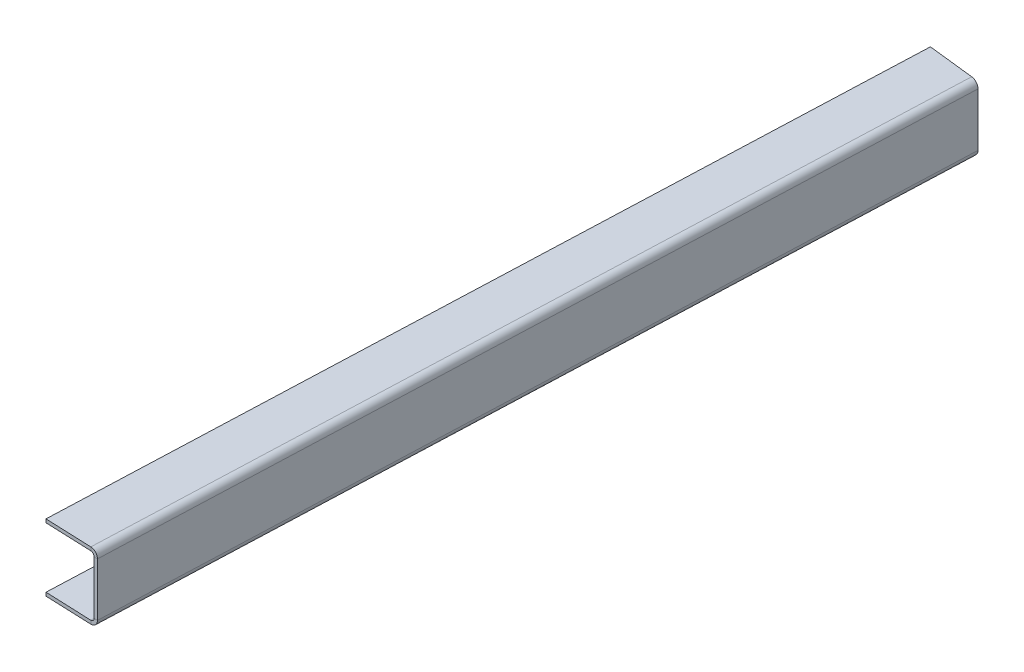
ISO-10303-21;
HEADER;
FILE_DESCRIPTION(('STEP AP214'),'2;1');
FILE_NAME('part.step','',(''),(''),'','','');
FILE_SCHEMA(('AUTOMOTIVE_DESIGN { 1 0 10303 214 1 1 1 1 }'));
ENDSEC;
DATA;
#1=APPLICATION_CONTEXT('core data for automotive mechanical design processes');
#2=APPLICATION_PROTOCOL_DEFINITION('international standard','automotive_design',2000,#1);
#3=PRODUCT_CONTEXT('',#1,'mechanical');
#4=PRODUCT('Part','Part','',(#3));
#5=PRODUCT_RELATED_PRODUCT_CATEGORY('part','',(#4));
#6=PRODUCT_DEFINITION_FORMATION('','',#4);
#7=PRODUCT_DEFINITION_CONTEXT('part definition',#1,'design');
#8=PRODUCT_DEFINITION('design','',#6,#7);
#9=PRODUCT_DEFINITION_SHAPE('','',#8);
#10=(LENGTH_UNIT() NAMED_UNIT(*) SI_UNIT(.MILLI.,.METRE.));
#11=(NAMED_UNIT(*) PLANE_ANGLE_UNIT() SI_UNIT($,.RADIAN.));
#12=(NAMED_UNIT(*) SI_UNIT($,.STERADIAN.) SOLID_ANGLE_UNIT());
#13=UNCERTAINTY_MEASURE_WITH_UNIT(LENGTH_MEASURE(1.E-05),#10,'distance_accuracy_value','');
#14=(GEOMETRIC_REPRESENTATION_CONTEXT(3) GLOBAL_UNCERTAINTY_ASSIGNED_CONTEXT((#13)) GLOBAL_UNIT_ASSIGNED_CONTEXT((#10,
#11,#12)) REPRESENTATION_CONTEXT('',''));
#15=CARTESIAN_POINT('',(0.,0.,0.));
#16=DIRECTION('',(0.,0.,1.));
#17=DIRECTION('',(1.,0.,0.));
#18=AXIS2_PLACEMENT_3D('',#15,#16,#17);
#19=CARTESIAN_POINT('',(-155.002975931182,0.,-777.838500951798));
#20=DIRECTION('',(0.0392134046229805,0.,-0.999230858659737));
#21=DIRECTION('',(0.,1.,0.));
#22=AXIS2_PLACEMENT_3D('',#19,#20,#21);
#23=PLANE('',#22);
#24=DIRECTION('',(-0.999230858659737,0.,-0.0392134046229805));
#25=VECTOR('',#24,1.);
#26=CARTESIAN_POINT('',(-155.002975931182,962.717491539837,-777.838500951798));
#27=LINE('',#26,#25);
#28=CARTESIAN_POINT('',(-153.378626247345,962.717491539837,-777.774755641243));
#29=VERTEX_POINT('',#28);
#30=CARTESIAN_POINT('',(-155.002975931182,962.717491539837,-777.838500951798));
#31=VERTEX_POINT('',#30);
#32=EDGE_CURVE('E12',#29,#31,#27,.T.);
#33=ORIENTED_EDGE('',*,*,#32,.F.);
#34=DIRECTION('',(0.,1.,0.));
#35=VECTOR('',#34,1.);
#36=CARTESIAN_POINT('',(-153.378626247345,0.,-777.774755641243));
#37=LINE('',#36,#35);
#38=CARTESIAN_POINT('',(-153.378626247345,987.965091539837,-777.774755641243));
#39=VERTEX_POINT('',#38);
#40=EDGE_CURVE('E137',#29,#39,#37,.T.);
#41=ORIENTED_EDGE('',*,*,#40,.T.);
#42=DIRECTION('',(-0.999230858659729,0.,-0.0392134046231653));
#43=VECTOR('',#42,1.);
#44=CARTESIAN_POINT('',(-155.002975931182,987.965091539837,-777.838500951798));
#45=LINE('',#44,#43);
#46=CARTESIAN_POINT('',(-155.002975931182,987.965091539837,-777.838500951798));
#47=VERTEX_POINT('',#46);
#48=EDGE_CURVE('E90',#39,#47,#45,.T.);
#49=ORIENTED_EDGE('',*,*,#48,.T.);
#50=DIRECTION('',(0.,1.,0.));
#51=VECTOR('',#50,1.);
#52=CARTESIAN_POINT('',(-155.002975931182,0.,-777.838500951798));
#53=LINE('',#52,#51);
#54=EDGE_CURVE('E139',#31,#47,#53,.T.);
#55=ORIENTED_EDGE('',*,*,#54,.F.);
#56=EDGE_LOOP('',(#33,#41,#49,#55));
#57=FACE_BOUND('',#56,.T.);
#58=ADVANCED_FACE('F78',(#57),#23,.F.);
#59=CARTESIAN_POINT('',(-158.251604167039,987.965091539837,-777.967804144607));
#60=CARTESIAN_POINT('',(-158.793054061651,987.965091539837,-777.989052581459));
#61=CARTESIAN_POINT('',(-159.334503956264,987.965091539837,-778.01030101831));
#62=CARTESIAN_POINT('',(-159.875953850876,987.965091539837,-778.031549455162));
#63=CARTESIAN_POINT('',(-158.251604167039,984.713891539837,-777.967804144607));
#64=CARTESIAN_POINT('',(-158.793054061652,983.630158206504,-777.989052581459));
#65=CARTESIAN_POINT('',(-159.334503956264,982.54642487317,-778.010301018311));
#66=CARTESIAN_POINT('',(-159.875953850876,981.462691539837,-778.031549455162));
#67=CARTESIAN_POINT('',(-155.002975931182,984.713891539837,-777.838500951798));
#68=CARTESIAN_POINT('',(-154.46152603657,983.630158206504,-777.817252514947));
#69=CARTESIAN_POINT('',(-153.920076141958,982.54642487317,-777.796004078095));
#70=CARTESIAN_POINT('',(-153.378626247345,981.462691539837,-777.774755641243));
#71=CARTESIAN_POINT('',(-155.002975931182,987.965091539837,-777.838500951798));
#72=CARTESIAN_POINT('',(-154.46152603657,987.965091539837,-777.817252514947));
#73=CARTESIAN_POINT('',(-153.920076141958,987.965091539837,-777.796004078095));
#74=CARTESIAN_POINT('',(-153.378626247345,987.965091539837,-777.774755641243));
#75=CARTESIAN_POINT('',(-155.002975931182,991.216291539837,-777.838500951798));
#76=CARTESIAN_POINT('',(-154.46152603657,992.30002487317,-777.817252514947));
#77=CARTESIAN_POINT('',(-153.920076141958,993.383758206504,-777.796004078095));
#78=CARTESIAN_POINT('',(-153.378626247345,994.467491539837,-777.774755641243));
#79=CARTESIAN_POINT('',(-158.251604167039,991.216291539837,-777.967804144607));
#80=CARTESIAN_POINT('',(-158.793054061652,992.30002487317,-777.989052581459));
#81=CARTESIAN_POINT('',(-159.334503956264,993.383758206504,-778.010301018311));
#82=CARTESIAN_POINT('',(-159.875953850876,994.467491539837,-778.031549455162));
#83=CARTESIAN_POINT('',(-158.251604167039,987.965091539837,-777.967804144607));
#84=CARTESIAN_POINT('',(-158.793054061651,987.965091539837,-777.989052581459));
#85=CARTESIAN_POINT('',(-159.334503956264,987.965091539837,-778.01030101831));
#86=CARTESIAN_POINT('',(-159.875953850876,987.965091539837,-778.031549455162));
#87=(BOUNDED_SURFACE() B_SPLINE_SURFACE(3,3,((#59,#60,#61,#62),(#63,#64,#65,#66),(#67,#68,#69,
#70),(#71,#72,#73,#74),(#75,#76,#77,#78),(#79,#80,#81,#82),(#83,#84,#85,#86)),.UNSPECIFIED.,.T.,
.F.,.F.) B_SPLINE_SURFACE_WITH_KNOTS((4,3,4),(4,4),(0.,0.5,1.),(0.,1.),
.UNSPECIFIED.) GEOMETRIC_REPRESENTATION_ITEM() RATIONAL_B_SPLINE_SURFACE(((1.,1.,1.,1.),
(0.333333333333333,0.333333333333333,0.333333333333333,0.333333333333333),(0.333333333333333,
0.333333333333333,0.333333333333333,0.333333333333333),(1.,1.,1.,1.),(0.333333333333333,
0.333333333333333,0.333333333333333,0.333333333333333),(0.333333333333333,0.333333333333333,
0.333333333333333,0.333333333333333),(1.,1.,1.,1.))) REPRESENTATION_ITEM('') SURFACE());
#88=CARTESIAN_POINT('',(-156.627290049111,987.965091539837,-777.903152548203));
#89=DIRECTION('',(-0.0394921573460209,0.,0.999219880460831));
#90=DIRECTION('',(-0.999219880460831,0.,-0.0394921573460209));
#91=AXIS2_PLACEMENT_3D('',#88,#89,#90);
#92=ELLIPSE('',#91,3.25120012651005,3.2512);
#93=CARTESIAN_POINT('',(-156.627290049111,991.216291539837,-777.903152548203));
#94=VERTEX_POINT('',#93);
#95=EDGE_CURVE('E215',#39,#94,#92,.T.);
#96=DIRECTION('',(0.,-1.,0.));
#97=VECTOR('',#96,1.);
#98=CARTESIAN_POINT('',(-156.627290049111,989.590691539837,-777.903152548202));
#99=LINE('',#98,#97);
#100=CARTESIAN_POINT('',(-156.627290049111,989.590691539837,-777.903152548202));
#101=VERTEX_POINT('',#100);
#102=EDGE_CURVE('E205',#94,#101,#99,.T.);
#103=CARTESIAN_POINT('',(-156.627290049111,987.965091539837,-777.903152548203));
#104=DIRECTION('',(-0.0397709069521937,0.,0.999208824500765));
#105=DIRECTION('',(-0.999208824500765,0.,-0.0397709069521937));
#106=AXIS2_PLACEMENT_3D('',#103,#104,#105);
#107=ELLIPSE('',#106,1.62560025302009,1.6256);
#108=EDGE_CURVE('E213',#47,#101,#107,.T.);
#109=ORIENTED_EDGE('',*,*,#48,.F.);
#110=ORIENTED_EDGE('',*,*,#95,.T.);
#111=ORIENTED_EDGE('',*,*,#102,.T.);
#112=ORIENTED_EDGE('',*,*,#108,.F.);
#113=EDGE_LOOP('',(#109,#110,#111,#112));
#114=FACE_BOUND('',#113,.T.);
#115=ADVANCED_FACE('F212',(#114),#87,.F.);
#116=CARTESIAN_POINT('',(-178.762960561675,989.590691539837,-778.784205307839));
#117=DIRECTION('',(-0.0397709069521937,0.,0.999208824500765));
#118=DIRECTION('',(0.999208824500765,0.,0.0397709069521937));
#119=AXIS2_PLACEMENT_3D('',#116,#117,#118);
#120=PLANE('',#119);
#121=ORIENTED_EDGE('',*,*,#102,.F.);
#122=DIRECTION('',(0.999208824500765,0.,0.0397709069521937));
#123=VECTOR('',#122,1.);
#124=CARTESIAN_POINT('',(-178.762960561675,991.216291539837,-778.784205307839));
#125=LINE('',#124,#123);
#126=CARTESIAN_POINT('',(-178.762960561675,991.216291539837,-778.784205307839));
#127=VERTEX_POINT('',#126);
#128=EDGE_CURVE('E176',#127,#94,#125,.T.);
#129=ORIENTED_EDGE('',*,*,#128,.F.);
#130=DIRECTION('',(0.,-1.,0.));
#131=VECTOR('',#130,1.);
#132=CARTESIAN_POINT('',(-178.762960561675,989.590691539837,-778.784205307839));
#133=LINE('',#132,#131);
#134=CARTESIAN_POINT('',(-178.762960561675,989.590691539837,-778.784205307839));
#135=VERTEX_POINT('',#134);
#136=EDGE_CURVE('E202',#127,#135,#133,.T.);
#137=ORIENTED_EDGE('',*,*,#136,.T.);
#138=DIRECTION('',(0.999208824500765,0.,0.0397709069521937));
#139=VECTOR('',#138,1.);
#140=CARTESIAN_POINT('',(-178.762960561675,989.590691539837,-778.784205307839));
#141=LINE('',#140,#139);
#142=EDGE_CURVE('E232',#135,#101,#141,.T.);
#143=ORIENTED_EDGE('',*,*,#142,.T.);
#144=EDGE_LOOP('',(#121,#129,#137,#143));
#145=FACE_BOUND('',#144,.T.);
#146=ADVANCED_FACE('F233',(#145),#120,.T.);
#147=CARTESIAN_POINT('',(-162.927940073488,989.590691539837,-1182.29013067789));
#148=DIRECTION('',(-0.999230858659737,0.,-0.0392134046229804));
#149=DIRECTION('',(-0.0392134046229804,0.,0.999230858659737));
#150=AXIS2_PLACEMENT_3D('',#147,#148,#149);
#151=PLANE('',#150);
#152=ORIENTED_EDGE('',*,*,#136,.F.);
#153=DIRECTION('',(-0.0392134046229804,0.,0.999230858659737));
#154=VECTOR('',#153,1.);
#155=CARTESIAN_POINT('',(-162.927940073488,991.216291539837,-1182.29013067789));
#156=LINE('',#155,#154);
#157=CARTESIAN_POINT('',(-162.927940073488,991.216291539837,-1182.29013067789));
#158=VERTEX_POINT('',#157);
#159=EDGE_CURVE('E168',#158,#127,#156,.T.);
#160=ORIENTED_EDGE('',*,*,#159,.F.);
#161=DIRECTION('',(0.,-1.,0.));
#162=VECTOR('',#161,1.);
#163=CARTESIAN_POINT('',(-162.927940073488,989.590691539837,-1182.29013067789));
#164=LINE('',#163,#162);
#165=CARTESIAN_POINT('',(-162.927940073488,989.590691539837,-1182.29013067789));
#166=VERTEX_POINT('',#165);
#167=EDGE_CURVE('E199',#158,#166,#164,.T.);
#168=ORIENTED_EDGE('',*,*,#167,.T.);
#169=DIRECTION('',(-0.0392134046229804,0.,0.999230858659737));
#170=VECTOR('',#169,1.);
#171=CARTESIAN_POINT('',(-162.927940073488,989.590691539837,-1182.29013067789));
#172=LINE('',#171,#170);
#173=EDGE_CURVE('E237',#166,#135,#172,.T.);
#174=ORIENTED_EDGE('',*,*,#173,.T.);
#175=EDGE_LOOP('',(#152,#160,#168,#174));
#176=FACE_BOUND('',#175,.T.);
#177=ADVANCED_FACE('F280',(#176),#151,.T.);
#178=CARTESIAN_POINT('',(-137.620859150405,989.590691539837,-1179.42417705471));
#179=DIRECTION('',(0.112527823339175,0.,-0.993648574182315));
#180=DIRECTION('',(-0.993648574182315,0.,-0.112527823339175));
#181=AXIS2_PLACEMENT_3D('',#178,#179,#180);
#182=PLANE('',#181);
#183=ORIENTED_EDGE('',*,*,#167,.F.);
#184=DIRECTION('',(-0.993648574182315,0.,-0.112527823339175));
#185=VECTOR('',#184,1.);
#186=CARTESIAN_POINT('',(-137.620859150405,991.216291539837,-1179.42417705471));
#187=LINE('',#186,#185);
#188=CARTESIAN_POINT('',(-140.855787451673,991.216291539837,-1179.79052331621));
#189=VERTEX_POINT('',#188);
#190=EDGE_CURVE('E173',#189,#158,#187,.T.);
#191=ORIENTED_EDGE('',*,*,#190,.F.);
#192=DIRECTION('',(0.,-1.,-2.73184799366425E-13));
#193=VECTOR('',#192,1.);
#194=CARTESIAN_POINT('',(-140.855787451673,989.590691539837,-1179.79052331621));
#195=LINE('',#194,#193);
#196=CARTESIAN_POINT('',(-140.855787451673,989.590691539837,-1179.79052331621));
#197=VERTEX_POINT('',#196);
#198=EDGE_CURVE('E196',#189,#197,#195,.T.);
#199=ORIENTED_EDGE('',*,*,#198,.T.);
#200=DIRECTION('',(-0.993648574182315,0.,-0.112527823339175));
#201=VECTOR('',#200,1.);
#202=CARTESIAN_POINT('',(-137.620859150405,989.590691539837,-1179.42417705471));
#203=LINE('',#202,#201);
#204=EDGE_CURVE('E238',#197,#166,#203,.T.);
#205=ORIENTED_EDGE('',*,*,#204,.T.);
#206=EDGE_LOOP('',(#183,#191,#199,#205));
#207=FACE_BOUND('',#206,.T.);
#208=ADVANCED_FACE('F307',(#207),#182,.T.);
#209=CARTESIAN_POINT('',(-142.47544063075,987.965091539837,-1179.9739443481));
#210=CARTESIAN_POINT('',(-143.016890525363,987.965091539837,-1179.99519278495));
#211=CARTESIAN_POINT('',(-143.558340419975,987.965091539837,-1180.0164412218));
#212=CARTESIAN_POINT('',(-144.099790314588,987.965091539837,-1180.03768965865));
#213=CARTESIAN_POINT('',(-142.47544063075,991.216291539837,-1179.9739443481));
#214=CARTESIAN_POINT('',(-143.016890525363,992.30002487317,-1179.99519278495));
#215=CARTESIAN_POINT('',(-143.558340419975,993.383758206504,-1180.0164412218));
#216=CARTESIAN_POINT('',(-144.099790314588,994.467491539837,-1180.03768965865));
#217=CARTESIAN_POINT('',(-139.236134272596,991.216291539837,-1179.60710228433));
#218=CARTESIAN_POINT('',(-138.694684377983,992.30002487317,-1179.58585384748));
#219=CARTESIAN_POINT('',(-138.153234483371,993.383758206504,-1179.56460541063));
#220=CARTESIAN_POINT('',(-137.611784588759,994.467491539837,-1179.54335697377));
#221=CARTESIAN_POINT('',(-139.236134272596,987.965091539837,-1179.60710228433));
#222=CARTESIAN_POINT('',(-138.694684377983,987.965091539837,-1179.58585384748));
#223=CARTESIAN_POINT('',(-138.153234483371,987.965091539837,-1179.56460541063));
#224=CARTESIAN_POINT('',(-137.611784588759,987.965091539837,-1179.54335697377));
#225=CARTESIAN_POINT('',(-139.236134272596,984.713891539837,-1179.60710228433));
#226=CARTESIAN_POINT('',(-138.694684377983,983.630158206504,-1179.58585384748));
#227=CARTESIAN_POINT('',(-138.153234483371,982.54642487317,-1179.56460541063));
#228=CARTESIAN_POINT('',(-137.611784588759,981.462691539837,-1179.54335697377));
#229=CARTESIAN_POINT('',(-142.47544063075,984.713891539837,-1179.9739443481));
#230=CARTESIAN_POINT('',(-143.016890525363,983.630158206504,-1179.99519278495));
#231=CARTESIAN_POINT('',(-143.558340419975,982.54642487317,-1180.0164412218));
#232=CARTESIAN_POINT('',(-144.099790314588,981.462691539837,-1180.03768965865));
#233=CARTESIAN_POINT('',(-142.47544063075,987.965091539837,-1179.9739443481));
#234=CARTESIAN_POINT('',(-143.016890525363,987.965091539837,-1179.99519278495));
#235=CARTESIAN_POINT('',(-143.558340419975,987.965091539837,-1180.0164412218));
#236=CARTESIAN_POINT('',(-144.099790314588,987.965091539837,-1180.03768965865));
#237=(BOUNDED_SURFACE() B_SPLINE_SURFACE(3,3,((#209,#210,#211,#212),(#213,#214,#215,#216),(#217,
#218,#219,#220),(#221,#222,#223,#224),(#225,#226,#227,#228),(#229,#230,#231,#232),(#233,#234,
#235,#236)),.UNSPECIFIED.,.T.,.F.,.F.) B_SPLINE_SURFACE_WITH_KNOTS((4,3,4),(4,4),(0.,0.5,1.),
(0.,1.),.UNSPECIFIED.) GEOMETRIC_REPRESENTATION_ITEM() RATIONAL_B_SPLINE_SURFACE(((1.,1.,1.,1.),
(0.333333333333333,0.333333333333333,0.333333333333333,0.333333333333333),(0.333333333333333,
0.333333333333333,0.333333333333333,0.333333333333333),(1.,1.,1.,1.),(0.333333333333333,
0.333333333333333,0.333333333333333,0.333333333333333),(0.333333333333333,0.333333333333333,
0.333333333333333,0.333333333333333),(1.,1.,1.,1.))) REPRESENTATION_ITEM('') SURFACE());
#238=CARTESIAN_POINT('',(-140.855787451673,987.965091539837,-1179.79052331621));
#239=DIRECTION('',(0.0759715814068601,0.,-0.997109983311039));
#240=DIRECTION('',(-0.997109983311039,0.,-0.0759715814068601));
#241=AXIS2_PLACEMENT_3D('',#238,#239,#240);
#242=ELLIPSE('',#241,3.25340525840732,3.2512);
#243=CARTESIAN_POINT('',(-137.611784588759,987.965091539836,-1179.54335697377));
#244=VERTEX_POINT('',#243);
#245=EDGE_CURVE('E178',#189,#244,#242,.T.);
#246=DIRECTION('',(-0.999230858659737,0.,-0.0392134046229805));
#247=VECTOR('',#246,1.);
#248=CARTESIAN_POINT('',(-139.236134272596,987.965091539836,-1179.60710228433));
#249=LINE('',#248,#247);
#250=CARTESIAN_POINT('',(-139.236134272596,987.965091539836,-1179.60710228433));
#251=VERTEX_POINT('',#250);
#252=EDGE_CURVE('E194',#244,#251,#249,.T.);
#253=CARTESIAN_POINT('',(-140.855787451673,987.965091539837,-1179.79052331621));
#254=DIRECTION('',(0.112527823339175,0.,-0.993648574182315));
#255=DIRECTION('',(-0.993648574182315,0.,-0.112527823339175));
#256=AXIS2_PLACEMENT_3D('',#253,#254,#255);
#257=ELLIPSE('',#256,1.63000604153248,1.6256);
#258=EDGE_CURVE('E229',#197,#251,#257,.T.);
#259=ORIENTED_EDGE('',*,*,#198,.F.);
#260=ORIENTED_EDGE('',*,*,#245,.T.);
#261=ORIENTED_EDGE('',*,*,#252,.T.);
#262=ORIENTED_EDGE('',*,*,#258,.F.);
#263=EDGE_LOOP('',(#259,#260,#261,#262));
#264=FACE_BOUND('',#263,.T.);
#265=ADVANCED_FACE('F357',(#264),#237,.F.);
#266=CARTESIAN_POINT('',(-139.236134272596,0.,-1179.60710228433));
#267=DIRECTION('',(-0.0392134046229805,0.,0.999230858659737));
#268=DIRECTION('',(0.,-1.,0.));
#269=AXIS2_PLACEMENT_3D('',#266,#267,#268);
#270=PLANE('',#269);
#271=ORIENTED_EDGE('',*,*,#252,.F.);
#272=DIRECTION('',(0.,1.,0.));
#273=VECTOR('',#272,1.);
#274=CARTESIAN_POINT('',(-137.611784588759,0.,-1179.54335697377));
#275=LINE('',#274,#273);
#276=CARTESIAN_POINT('',(-137.611784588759,962.717491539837,-1179.54335697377));
#277=VERTEX_POINT('',#276);
#278=EDGE_CURVE('E167',#244,#277,#275,.F.);
#279=ORIENTED_EDGE('',*,*,#278,.T.);
#280=DIRECTION('',(-0.999230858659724,1.42137874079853E-13,-0.0392134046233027));
#281=VECTOR('',#280,1.);
#282=CARTESIAN_POINT('',(-139.236134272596,962.717491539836,-1179.60710228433));
#283=LINE('',#282,#281);
#284=CARTESIAN_POINT('',(-139.236134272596,962.717491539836,-1179.60710228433));
#285=VERTEX_POINT('',#284);
#286=EDGE_CURVE('E191',#277,#285,#283,.T.);
#287=ORIENTED_EDGE('',*,*,#286,.T.);
#288=DIRECTION('',(0.,-1.,0.));
#289=VECTOR('',#288,1.);
#290=CARTESIAN_POINT('',(-139.236134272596,0.,-1179.60710228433));
#291=LINE('',#290,#289);
#292=EDGE_CURVE('E284',#251,#285,#291,.T.);
#293=ORIENTED_EDGE('',*,*,#292,.F.);
#294=EDGE_LOOP('',(#271,#279,#287,#293));
#295=FACE_BOUND('',#294,.T.);
#296=ADVANCED_FACE('F322',(#295),#270,.F.);
#297=CARTESIAN_POINT('',(-139.236134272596,962.717491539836,-1179.60710228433));
#298=CARTESIAN_POINT('',(-138.694684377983,962.717491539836,-1179.58585384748));
#299=CARTESIAN_POINT('',(-138.153234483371,962.717491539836,-1179.56460541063));
#300=CARTESIAN_POINT('',(-137.611784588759,962.717491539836,-1179.54335697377));
#301=CARTESIAN_POINT('',(-139.236134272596,959.466291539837,-1179.60710228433));
#302=CARTESIAN_POINT('',(-138.694684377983,958.382558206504,-1179.58585384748));
#303=CARTESIAN_POINT('',(-138.153234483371,957.29882487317,-1179.56460541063));
#304=CARTESIAN_POINT('',(-137.611784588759,956.215091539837,-1179.54335697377));
#305=CARTESIAN_POINT('',(-142.47544063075,959.466291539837,-1179.9739443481));
#306=CARTESIAN_POINT('',(-143.016890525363,958.382558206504,-1179.99519278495));
#307=CARTESIAN_POINT('',(-143.558340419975,957.29882487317,-1180.0164412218));
#308=CARTESIAN_POINT('',(-144.099790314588,956.215091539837,-1180.03768965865));
#309=CARTESIAN_POINT('',(-142.47544063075,962.717491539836,-1179.9739443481));
#310=CARTESIAN_POINT('',(-143.016890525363,962.717491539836,-1179.99519278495));
#311=CARTESIAN_POINT('',(-143.558340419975,962.717491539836,-1180.0164412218));
#312=CARTESIAN_POINT('',(-144.099790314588,962.717491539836,-1180.03768965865));
#313=CARTESIAN_POINT('',(-142.47544063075,965.968691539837,-1179.9739443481));
#314=CARTESIAN_POINT('',(-143.016890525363,967.05242487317,-1179.99519278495));
#315=CARTESIAN_POINT('',(-143.558340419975,968.136158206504,-1180.0164412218));
#316=CARTESIAN_POINT('',(-144.099790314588,969.219891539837,-1180.03768965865));
#317=CARTESIAN_POINT('',(-139.236134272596,965.968691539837,-1179.60710228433));
#318=CARTESIAN_POINT('',(-138.694684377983,967.05242487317,-1179.58585384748));
#319=CARTESIAN_POINT('',(-138.153234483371,968.136158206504,-1179.56460541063));
#320=CARTESIAN_POINT('',(-137.611784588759,969.219891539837,-1179.54335697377));
#321=CARTESIAN_POINT('',(-139.236134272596,962.717491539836,-1179.60710228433));
#322=CARTESIAN_POINT('',(-138.694684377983,962.717491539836,-1179.58585384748));
#323=CARTESIAN_POINT('',(-138.153234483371,962.717491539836,-1179.56460541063));
#324=CARTESIAN_POINT('',(-137.611784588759,962.717491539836,-1179.54335697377));
#325=(BOUNDED_SURFACE() B_SPLINE_SURFACE(3,3,((#297,#298,#299,#300),(#301,#302,#303,#304),(#305,
#306,#307,#308),(#309,#310,#311,#312),(#313,#314,#315,#316),(#317,#318,#319,#320),(#321,#322,
#323,#324)),.UNSPECIFIED.,.T.,.F.,.F.) B_SPLINE_SURFACE_WITH_KNOTS((4,3,4),(4,4),(0.,0.5,1.),
(0.,1.),.UNSPECIFIED.) GEOMETRIC_REPRESENTATION_ITEM() RATIONAL_B_SPLINE_SURFACE(((1.,1.,1.,1.),
(0.333333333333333,0.333333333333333,0.333333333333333,0.333333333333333),(0.333333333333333,
0.333333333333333,0.333333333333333,0.333333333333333),(1.,1.,1.,1.),(0.333333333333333,
0.333333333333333,0.333333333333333,0.333333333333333),(0.333333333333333,0.333333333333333,
0.333333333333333,0.333333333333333),(1.,1.,1.,1.))) REPRESENTATION_ITEM('') SURFACE());
#326=CARTESIAN_POINT('',(-140.855787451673,962.717491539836,-1179.79052331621));
#327=DIRECTION('',(0.0759715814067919,0.,-0.997109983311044));
#328=DIRECTION('',(0.997109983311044,0.,0.0759715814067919));
#329=AXIS2_PLACEMENT_3D('',#326,#327,#328);
#330=ELLIPSE('',#329,3.25340525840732,3.2512);
#331=CARTESIAN_POINT('',(-140.855787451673,959.466291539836,-1179.79052331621));
#332=VERTEX_POINT('',#331);
#333=EDGE_CURVE('E155',#277,#332,#330,.T.);
#334=DIRECTION('',(0.,1.,0.));
#335=VECTOR('',#334,1.);
#336=CARTESIAN_POINT('',(-140.855787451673,961.091891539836,-1179.79052331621));
#337=LINE('',#336,#335);
#338=CARTESIAN_POINT('',(-140.855787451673,961.091891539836,-1179.79052331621));
#339=VERTEX_POINT('',#338);
#340=EDGE_CURVE('E188',#332,#339,#337,.T.);
#341=CARTESIAN_POINT('',(-140.855787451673,962.717491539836,-1179.79052331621));
#342=DIRECTION('',(0.112527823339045,0.,-0.99364857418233));
#343=DIRECTION('',(0.99364857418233,0.,0.112527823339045));
#344=AXIS2_PLACEMENT_3D('',#341,#342,#343);
#345=ELLIPSE('',#344,1.63000604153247,1.6256);
#346=EDGE_CURVE('E254',#285,#339,#345,.T.);
#347=ORIENTED_EDGE('',*,*,#286,.F.);
#348=ORIENTED_EDGE('',*,*,#333,.T.);
#349=ORIENTED_EDGE('',*,*,#340,.T.);
#350=ORIENTED_EDGE('',*,*,#346,.F.);
#351=EDGE_LOOP('',(#347,#348,#349,#350));
#352=FACE_BOUND('',#351,.T.);
#353=ADVANCED_FACE('F326',(#352),#325,.F.);
#354=CARTESIAN_POINT('',(-162.927940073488,961.091891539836,-1182.29013067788));
#355=DIRECTION('',(0.112527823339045,0.,-0.99364857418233));
#356=DIRECTION('',(0.99364857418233,0.,0.112527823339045));
#357=AXIS2_PLACEMENT_3D('',#354,#355,#356);
#358=PLANE('',#357);
#359=ORIENTED_EDGE('',*,*,#340,.F.);
#360=DIRECTION('',(0.99364857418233,0.,0.112527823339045));
#361=VECTOR('',#360,1.);
#362=CARTESIAN_POINT('',(-162.927940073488,959.466291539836,-1182.29013067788));
#363=LINE('',#362,#361);
#364=CARTESIAN_POINT('',(-162.927940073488,959.466291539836,-1182.29013067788));
#365=VERTEX_POINT('',#364);
#366=EDGE_CURVE('E262',#365,#332,#363,.T.);
#367=ORIENTED_EDGE('',*,*,#366,.F.);
#368=DIRECTION('',(0.,1.,0.));
#369=VECTOR('',#368,1.);
#370=CARTESIAN_POINT('',(-162.927940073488,961.091891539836,-1182.29013067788));
#371=LINE('',#370,#369);
#372=CARTESIAN_POINT('',(-162.927940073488,961.091891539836,-1182.29013067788));
#373=VERTEX_POINT('',#372);
#374=EDGE_CURVE('E185',#365,#373,#371,.T.);
#375=ORIENTED_EDGE('',*,*,#374,.T.);
#376=DIRECTION('',(0.99364857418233,0.,0.112527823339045));
#377=VECTOR('',#376,1.);
#378=CARTESIAN_POINT('',(-162.927940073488,961.091891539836,-1182.29013067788));
#379=LINE('',#378,#377);
#380=EDGE_CURVE('E293',#373,#339,#379,.T.);
#381=ORIENTED_EDGE('',*,*,#380,.T.);
#382=EDGE_LOOP('',(#359,#367,#375,#381));
#383=FACE_BOUND('',#382,.T.);
#384=ADVANCED_FACE('F374',(#383),#358,.T.);
#385=CARTESIAN_POINT('',(-178.762960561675,961.091891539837,-778.784205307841));
#386=DIRECTION('',(-0.999230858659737,0.,-0.0392134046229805));
#387=DIRECTION('',(0.0392134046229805,0.,-0.999230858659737));
#388=AXIS2_PLACEMENT_3D('',#385,#386,#387);
#389=PLANE('',#388);
#390=ORIENTED_EDGE('',*,*,#374,.F.);
#391=DIRECTION('',(0.0392134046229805,0.,-0.999230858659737));
#392=VECTOR('',#391,1.);
#393=CARTESIAN_POINT('',(-178.762960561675,959.466291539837,-778.784205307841));
#394=LINE('',#393,#392);
#395=CARTESIAN_POINT('',(-178.762960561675,959.466291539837,-778.784205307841));
#396=VERTEX_POINT('',#395);
#397=EDGE_CURVE('E255',#396,#365,#394,.T.);
#398=ORIENTED_EDGE('',*,*,#397,.F.);
#399=DIRECTION('',(0.,1.,0.));
#400=VECTOR('',#399,1.);
#401=CARTESIAN_POINT('',(-178.762960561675,961.091891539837,-778.784205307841));
#402=LINE('',#401,#400);
#403=CARTESIAN_POINT('',(-178.762960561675,961.091891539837,-778.784205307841));
#404=VERTEX_POINT('',#403);
#405=EDGE_CURVE('E182',#396,#404,#402,.T.);
#406=ORIENTED_EDGE('',*,*,#405,.T.);
#407=DIRECTION('',(0.0392134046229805,0.,-0.999230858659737));
#408=VECTOR('',#407,1.);
#409=CARTESIAN_POINT('',(-178.762960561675,961.091891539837,-778.784205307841));
#410=LINE('',#409,#408);
#411=EDGE_CURVE('E296',#404,#373,#410,.T.);
#412=ORIENTED_EDGE('',*,*,#411,.T.);
#413=EDGE_LOOP('',(#390,#398,#406,#412));
#414=FACE_BOUND('',#413,.T.);
#415=ADVANCED_FACE('F382',(#414),#389,.T.);
#416=CARTESIAN_POINT('',(-153.383052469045,961.091891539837,-777.774024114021));
#417=DIRECTION('',(-0.0397709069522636,0.,0.999208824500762));
#418=DIRECTION('',(-0.999208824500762,0.,-0.0397709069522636));
#419=AXIS2_PLACEMENT_3D('',#416,#417,#418);
#420=PLANE('',#419);
#421=ORIENTED_EDGE('',*,*,#405,.F.);
#422=DIRECTION('',(-0.999208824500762,0.,-0.0397709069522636));
#423=VECTOR('',#422,1.);
#424=CARTESIAN_POINT('',(-153.383052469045,959.466291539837,-777.774024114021));
#425=LINE('',#424,#423);
#426=CARTESIAN_POINT('',(-156.627290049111,959.466291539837,-777.903152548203));
#427=VERTEX_POINT('',#426);
#428=EDGE_CURVE('E259',#427,#396,#425,.T.);
#429=ORIENTED_EDGE('',*,*,#428,.F.);
#430=DIRECTION('',(0.,1.,-1.36592399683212E-13));
#431=VECTOR('',#430,1.);
#432=CARTESIAN_POINT('',(-156.627290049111,961.091891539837,-777.903152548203));
#433=LINE('',#432,#431);
#434=CARTESIAN_POINT('',(-156.627290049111,961.091891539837,-777.903152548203));
#435=VERTEX_POINT('',#434);
#436=EDGE_CURVE('E84',#427,#435,#433,.T.);
#437=ORIENTED_EDGE('',*,*,#436,.T.);
#438=DIRECTION('',(-0.999208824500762,0.,-0.0397709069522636));
#439=VECTOR('',#438,1.);
#440=CARTESIAN_POINT('',(-153.383052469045,961.091891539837,-777.774024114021));
#441=LINE('',#440,#439);
#442=EDGE_CURVE('E290',#435,#404,#441,.T.);
#443=ORIENTED_EDGE('',*,*,#442,.T.);
#444=EDGE_LOOP('',(#421,#429,#437,#443));
#445=FACE_BOUND('',#444,.T.);
#446=ADVANCED_FACE('F386',(#445),#420,.T.);
#447=CARTESIAN_POINT('',(-155.002975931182,962.717491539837,-777.838500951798));
#448=CARTESIAN_POINT('',(-154.46152603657,962.717491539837,-777.817252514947));
#449=CARTESIAN_POINT('',(-153.920076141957,962.717491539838,-777.796004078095));
#450=CARTESIAN_POINT('',(-153.378626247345,962.717491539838,-777.774755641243));
#451=CARTESIAN_POINT('',(-155.002975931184,965.968691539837,-777.838500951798));
#452=CARTESIAN_POINT('',(-154.461526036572,967.052424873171,-777.817252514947));
#453=CARTESIAN_POINT('',(-153.92007614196,968.136158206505,-777.796004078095));
#454=CARTESIAN_POINT('',(-153.378626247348,969.219891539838,-777.774755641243));
#455=CARTESIAN_POINT('',(-158.251604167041,965.968691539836,-777.967804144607));
#456=CARTESIAN_POINT('',(-158.793054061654,967.052424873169,-777.989052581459));
#457=CARTESIAN_POINT('',(-159.334503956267,968.136158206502,-778.010301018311));
#458=CARTESIAN_POINT('',(-159.875953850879,969.219891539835,-778.031549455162));
#459=CARTESIAN_POINT('',(-158.251604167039,962.717491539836,-777.967804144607));
#460=CARTESIAN_POINT('',(-158.793054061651,962.717491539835,-777.989052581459));
#461=CARTESIAN_POINT('',(-159.334503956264,962.717491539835,-778.010301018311));
#462=CARTESIAN_POINT('',(-159.875953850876,962.717491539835,-778.031549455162));
#463=CARTESIAN_POINT('',(-158.251604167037,959.466291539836,-777.967804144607));
#464=CARTESIAN_POINT('',(-158.793054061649,958.382558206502,-777.989052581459));
#465=CARTESIAN_POINT('',(-159.334503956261,957.298824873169,-778.010301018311));
#466=CARTESIAN_POINT('',(-159.875953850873,956.215091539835,-778.031549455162));
#467=CARTESIAN_POINT('',(-155.002975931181,959.466291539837,-777.838500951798));
#468=CARTESIAN_POINT('',(-154.461526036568,958.382558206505,-777.817252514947));
#469=CARTESIAN_POINT('',(-153.920076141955,957.298824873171,-777.796004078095));
#470=CARTESIAN_POINT('',(-153.378626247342,956.215091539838,-777.774755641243));
#471=CARTESIAN_POINT('',(-155.002975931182,962.717491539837,-777.838500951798));
#472=CARTESIAN_POINT('',(-154.46152603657,962.717491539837,-777.817252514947));
#473=CARTESIAN_POINT('',(-153.920076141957,962.717491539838,-777.796004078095));
#474=CARTESIAN_POINT('',(-153.378626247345,962.717491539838,-777.774755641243));
#475=(BOUNDED_SURFACE() B_SPLINE_SURFACE(3,3,((#447,#448,#449,#450),(#451,#452,#453,#454),(#455,
#456,#457,#458),(#459,#460,#461,#462),(#463,#464,#465,#466),(#467,#468,#469,#470),(#471,#472,
#473,#474)),.UNSPECIFIED.,.T.,.F.,.F.) B_SPLINE_SURFACE_WITH_KNOTS((4,3,4),(4,4),(0.,0.5,1.),
(0.,1.),.UNSPECIFIED.) GEOMETRIC_REPRESENTATION_ITEM() RATIONAL_B_SPLINE_SURFACE(((1.,1.,1.,1.),
(0.333333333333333,0.333333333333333,0.333333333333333,0.333333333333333),(0.333333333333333,
0.333333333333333,0.333333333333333,0.333333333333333),(1.,1.,1.,1.),(0.333333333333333,
0.333333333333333,0.333333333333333,0.333333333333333),(0.333333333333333,0.333333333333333,
0.333333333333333,0.333333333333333),(1.,1.,1.,1.))) REPRESENTATION_ITEM('') SURFACE());
#476=CARTESIAN_POINT('',(-156.627290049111,962.717491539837,-777.903152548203));
#477=DIRECTION('',(-0.039492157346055,0.,0.99921988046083));
#478=DIRECTION('',(0.99921988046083,4.78073380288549E-13,0.039492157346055));
#479=AXIS2_PLACEMENT_3D('',#476,#477,#478);
#480=ELLIPSE('',#479,3.25120012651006,3.2512);
#481=EDGE_CURVE('E152',#427,#29,#480,.T.);
#482=CARTESIAN_POINT('',(-156.627290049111,962.717491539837,-777.903152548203));
#483=DIRECTION('',(-0.0397709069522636,0.,0.999208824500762));
#484=DIRECTION('',(0.999208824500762,4.95042548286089E-13,0.0397709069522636));
#485=AXIS2_PLACEMENT_3D('',#482,#483,#484);
#486=ELLIPSE('',#485,1.62560025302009,1.6256);
#487=EDGE_CURVE('E250',#435,#31,#486,.T.);
#488=ORIENTED_EDGE('',*,*,#481,.T.);
#489=ORIENTED_EDGE('',*,*,#32,.T.);
#490=ORIENTED_EDGE('',*,*,#487,.F.);
#491=ORIENTED_EDGE('',*,*,#436,.F.);
#492=EDGE_LOOP('',(#488,#489,#490,#491));
#493=FACE_BOUND('',#492,.T.);
#494=ADVANCED_FACE('F80',(#493),#475,.F.);
#495=CARTESIAN_POINT('',(0.,961.091891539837,-2.69722192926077E-13));
#496=DIRECTION('',(0.,-1.,0.));
#497=DIRECTION('',(0.,0.,-1.));
#498=AXIS2_PLACEMENT_3D('',#495,#496,#497);
#499=PLANE('',#498);
#500=ORIENTED_EDGE('',*,*,#442,.F.);
#501=DIRECTION('',(0.0392134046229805,0.,-0.999230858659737));
#502=VECTOR('',#501,1.);
#503=CARTESIAN_POINT('',(-140.860483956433,961.091891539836,-1179.67084759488));
#504=LINE('',#503,#502);
#505=EDGE_CURVE('E247',#435,#339,#504,.T.);
#506=ORIENTED_EDGE('',*,*,#505,.T.);
#507=ORIENTED_EDGE('',*,*,#380,.F.);
#508=ORIENTED_EDGE('',*,*,#411,.F.);
#509=EDGE_LOOP('',(#500,#506,#507,#508));
#510=FACE_BOUND('',#509,.T.);
#511=ADVANCED_FACE('F411',(#510),#499,.F.);
#512=CARTESIAN_POINT('',(-185.240523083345,0.,-7.32927087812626));
#513=DIRECTION('',(0.999230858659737,0.,0.0392134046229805));
#514=DIRECTION('',(0.0392134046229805,0.,-0.999230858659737));
#515=AXIS2_PLACEMENT_3D('',#512,#513,#514);
#516=PLANE('',#515);
#517=ORIENTED_EDGE('',*,*,#54,.T.);
#518=DIRECTION('',(-0.0392134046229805,0.,0.999230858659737));
#519=VECTOR('',#518,1.);
#520=CARTESIAN_POINT('',(-139.236134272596,987.965091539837,-1179.60710228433));
#521=LINE('',#520,#519);
#522=EDGE_CURVE('E228',#47,#251,#521,.F.);
#523=ORIENTED_EDGE('',*,*,#522,.T.);
#524=ORIENTED_EDGE('',*,*,#292,.T.);
#525=DIRECTION('',(0.0392134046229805,0.,-0.999230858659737));
#526=VECTOR('',#525,1.);
#527=CARTESIAN_POINT('',(-155.002975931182,962.717491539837,-777.838500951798));
#528=LINE('',#527,#526);
#529=EDGE_CURVE('E244',#285,#31,#528,.F.);
#530=ORIENTED_EDGE('',*,*,#529,.T.);
#531=EDGE_LOOP('',(#517,#523,#524,#530));
#532=FACE_BOUND('',#531,.T.);
#533=ADVANCED_FACE('F325',(#532),#516,.F.);
#534=CARTESIAN_POINT('',(0.,989.590691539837,0.));
#535=DIRECTION('',(0.,1.,0.));
#536=DIRECTION('',(0.,0.,1.));
#537=AXIS2_PLACEMENT_3D('',#534,#535,#536);
#538=PLANE('',#537);
#539=ORIENTED_EDGE('',*,*,#204,.F.);
#540=DIRECTION('',(-0.0392134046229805,0.,0.999230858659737));
#541=VECTOR('',#540,1.);
#542=CARTESIAN_POINT('',(-156.62732561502,989.590691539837,-777.902246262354));
#543=LINE('',#542,#541);
#544=EDGE_CURVE('E226',#197,#101,#543,.T.);
#545=ORIENTED_EDGE('',*,*,#544,.T.);
#546=ORIENTED_EDGE('',*,*,#142,.F.);
#547=ORIENTED_EDGE('',*,*,#173,.F.);
#548=EDGE_LOOP('',(#539,#545,#546,#547));
#549=FACE_BOUND('',#548,.T.);
#550=ADVANCED_FACE('F241',(#549),#538,.F.);
#551=CARTESIAN_POINT('',(-186.867214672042,962.717491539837,-7.33334007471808));
#552=DIRECTION('',(-0.0392134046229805,0.,0.999230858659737));
#553=DIRECTION('',(0.999230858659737,0.,0.0392134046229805));
#554=AXIS2_PLACEMENT_3D('',#551,#552,#553);
#555=CYLINDRICAL_SURFACE('',#554,1.6256);
#556=ORIENTED_EDGE('',*,*,#487,.T.);
#557=ORIENTED_EDGE('',*,*,#529,.F.);
#558=ORIENTED_EDGE('',*,*,#346,.T.);
#559=ORIENTED_EDGE('',*,*,#505,.F.);
#560=EDGE_LOOP('',(#556,#557,#558,#559));
#561=FACE_BOUND('',#560,.T.);
#562=ADVANCED_FACE('F327',(#561),#555,.F.);
#563=CARTESIAN_POINT('',(-186.867214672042,987.965091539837,-7.3333400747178));
#564=DIRECTION('',(0.0392134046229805,0.,-0.999230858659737));
#565=DIRECTION('',(-0.999230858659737,0.,-0.0392134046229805));
#566=AXIS2_PLACEMENT_3D('',#563,#564,#565);
#567=CYLINDRICAL_SURFACE('',#566,1.6256);
#568=ORIENTED_EDGE('',*,*,#258,.T.);
#569=ORIENTED_EDGE('',*,*,#522,.F.);
#570=ORIENTED_EDGE('',*,*,#108,.T.);
#571=ORIENTED_EDGE('',*,*,#544,.F.);
#572=EDGE_LOOP('',(#568,#569,#570,#571));
#573=FACE_BOUND('',#572,.T.);
#574=ADVANCED_FACE('F224',(#573),#567,.F.);
#575=CARTESIAN_POINT('',(0.,959.466291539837,-2.6927484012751E-13));
#576=DIRECTION('',(0.,-1.,0.));
#577=DIRECTION('',(0.,0.,-1.));
#578=AXIS2_PLACEMENT_3D('',#575,#576,#577);
#579=PLANE('',#578);
#580=ORIENTED_EDGE('',*,*,#428,.T.);
#581=ORIENTED_EDGE('',*,*,#397,.T.);
#582=ORIENTED_EDGE('',*,*,#366,.T.);
#583=DIRECTION('',(-0.0392134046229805,0.,0.999230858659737));
#584=VECTOR('',#583,1.);
#585=CARTESIAN_POINT('',(-186.867214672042,959.466291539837,-7.33334007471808));
#586=LINE('',#585,#584);
#587=EDGE_CURVE('E160',#427,#332,#586,.F.);
#588=ORIENTED_EDGE('',*,*,#587,.F.);
#589=EDGE_LOOP('',(#580,#581,#582,#588));
#590=FACE_BOUND('',#589,.T.);
#591=ADVANCED_FACE('F334',(#590),#579,.T.);
#592=CARTESIAN_POINT('',(-183.616173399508,0.,-7.26552556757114));
#593=DIRECTION('',(0.999230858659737,0.,0.0392134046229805));
#594=DIRECTION('',(0.0392134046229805,0.,-0.999230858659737));
#595=AXIS2_PLACEMENT_3D('',#592,#593,#594);
#596=PLANE('',#595);
#597=ORIENTED_EDGE('',*,*,#40,.F.);
#598=DIRECTION('',(0.0392134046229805,0.,-0.999230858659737));
#599=VECTOR('',#598,1.);
#600=CARTESIAN_POINT('',(-183.616173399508,962.717491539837,-7.26552556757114));
#601=LINE('',#600,#599);
#602=EDGE_CURVE('E149',#277,#29,#601,.F.);
#603=ORIENTED_EDGE('',*,*,#602,.F.);
#604=ORIENTED_EDGE('',*,*,#278,.F.);
#605=DIRECTION('',(0.0392134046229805,0.,-0.999230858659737));
#606=VECTOR('',#605,1.);
#607=CARTESIAN_POINT('',(-183.616173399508,987.965091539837,-7.26552556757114));
#608=LINE('',#607,#606);
#609=EDGE_CURVE('E165',#39,#244,#608,.T.);
#610=ORIENTED_EDGE('',*,*,#609,.F.);
#611=EDGE_LOOP('',(#597,#603,#604,#610));
#612=FACE_BOUND('',#611,.T.);
#613=ADVANCED_FACE('F163',(#612),#596,.T.);
#614=CARTESIAN_POINT('',(0.,991.216291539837,0.));
#615=DIRECTION('',(0.,1.,0.));
#616=DIRECTION('',(0.,0.,1.));
#617=AXIS2_PLACEMENT_3D('',#614,#615,#616);
#618=PLANE('',#617);
#619=ORIENTED_EDGE('',*,*,#190,.T.);
#620=ORIENTED_EDGE('',*,*,#159,.T.);
#621=ORIENTED_EDGE('',*,*,#128,.T.);
#622=DIRECTION('',(0.0392134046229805,0.,-0.999230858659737));
#623=VECTOR('',#622,1.);
#624=CARTESIAN_POINT('',(-186.867214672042,991.216291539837,-7.3333400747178));
#625=LINE('',#624,#623);
#626=EDGE_CURVE('E159',#189,#94,#625,.F.);
#627=ORIENTED_EDGE('',*,*,#626,.F.);
#628=EDGE_LOOP('',(#619,#620,#621,#627));
#629=FACE_BOUND('',#628,.T.);
#630=ADVANCED_FACE('F275',(#629),#618,.T.);
#631=CARTESIAN_POINT('',(-186.867214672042,962.717491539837,-7.33334007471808));
#632=DIRECTION('',(-0.0392134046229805,0.,0.999230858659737));
#633=DIRECTION('',(0.999230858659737,0.,0.0392134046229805));
#634=AXIS2_PLACEMENT_3D('',#631,#632,#633);
#635=CYLINDRICAL_SURFACE('',#634,3.2512);
#636=ORIENTED_EDGE('',*,*,#481,.F.);
#637=ORIENTED_EDGE('',*,*,#587,.T.);
#638=ORIENTED_EDGE('',*,*,#333,.F.);
#639=ORIENTED_EDGE('',*,*,#602,.T.);
#640=EDGE_LOOP('',(#636,#637,#638,#639));
#641=FACE_BOUND('',#640,.T.);
#642=ADVANCED_FACE('F150',(#641),#635,.T.);
#643=CARTESIAN_POINT('',(-186.867214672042,987.965091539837,-7.3333400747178));
#644=DIRECTION('',(0.0392134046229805,0.,-0.999230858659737));
#645=DIRECTION('',(-0.999230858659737,0.,-0.0392134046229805));
#646=AXIS2_PLACEMENT_3D('',#643,#644,#645);
#647=CYLINDRICAL_SURFACE('',#646,3.2512);
#648=ORIENTED_EDGE('',*,*,#245,.F.);
#649=ORIENTED_EDGE('',*,*,#626,.T.);
#650=ORIENTED_EDGE('',*,*,#95,.F.);
#651=ORIENTED_EDGE('',*,*,#609,.T.);
#652=EDGE_LOOP('',(#648,#649,#650,#651));
#653=FACE_BOUND('',#652,.T.);
#654=ADVANCED_FACE('F391',(#653),#647,.T.);
#655=CLOSED_SHELL('',(#58,#115,#146,#177,#208,#265,#296,#353,#384,#415,#446,#494,#511,#533,#550,
#562,#574,#591,#613,#630,#642,#654));
#656=MANIFOLD_SOLID_BREP('B2',#655);
#657=ADVANCED_BREP_SHAPE_REPRESENTATION('',(#18,#656),#14);
#658=SHAPE_DEFINITION_REPRESENTATION(#9,#657);
ENDSEC;
END-ISO-10303-21;
